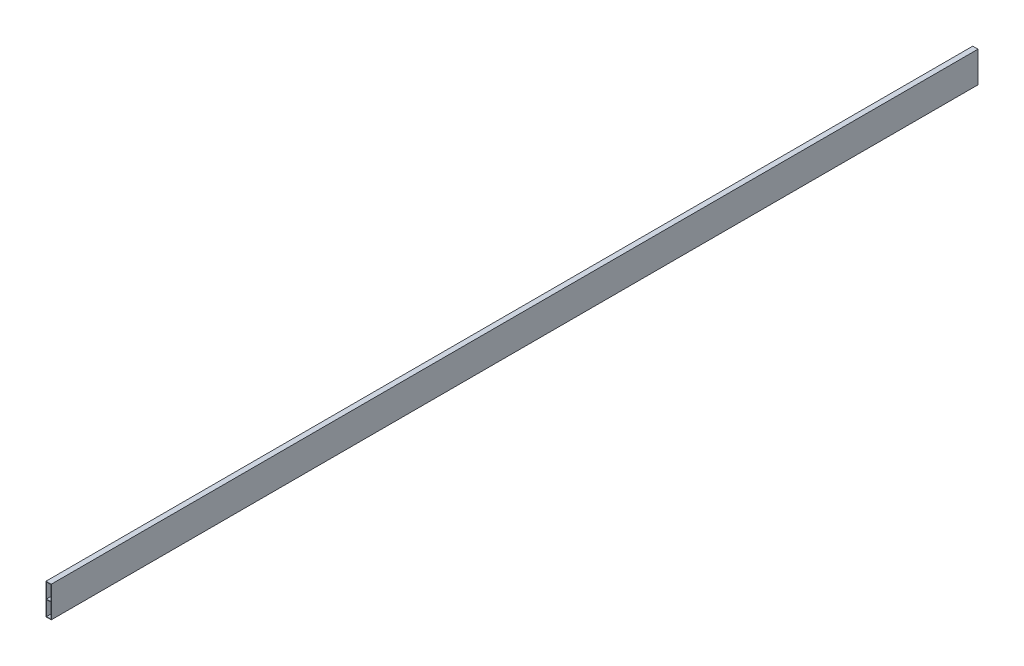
ISO-10303-21;
HEADER;
FILE_DESCRIPTION(('STEP AP214'),'2;1');
FILE_NAME('part.step','',(''),(''),'','','');
FILE_SCHEMA(('AUTOMOTIVE_DESIGN { 1 0 10303 214 1 1 1 1 }'));
ENDSEC;
DATA;
#1=APPLICATION_CONTEXT('core data for automotive mechanical design processes');
#2=APPLICATION_PROTOCOL_DEFINITION('international standard','automotive_design',2000,#1);
#3=PRODUCT_CONTEXT('',#1,'mechanical');
#4=PRODUCT('Part','Part','',(#3));
#5=PRODUCT_RELATED_PRODUCT_CATEGORY('part','',(#4));
#6=PRODUCT_DEFINITION_FORMATION('','',#4);
#7=PRODUCT_DEFINITION_CONTEXT('part definition',#1,'design');
#8=PRODUCT_DEFINITION('design','',#6,#7);
#9=PRODUCT_DEFINITION_SHAPE('','',#8);
#10=(LENGTH_UNIT() NAMED_UNIT(*) SI_UNIT(.MILLI.,.METRE.));
#11=(NAMED_UNIT(*) PLANE_ANGLE_UNIT() SI_UNIT($,.RADIAN.));
#12=(NAMED_UNIT(*) SI_UNIT($,.STERADIAN.) SOLID_ANGLE_UNIT());
#13=UNCERTAINTY_MEASURE_WITH_UNIT(LENGTH_MEASURE(1.E-05),#10,'distance_accuracy_value','');
#14=(GEOMETRIC_REPRESENTATION_CONTEXT(3) GLOBAL_UNCERTAINTY_ASSIGNED_CONTEXT((#13)) GLOBAL_UNIT_ASSIGNED_CONTEXT((#10,
#11,#12)) REPRESENTATION_CONTEXT('',''));
#15=CARTESIAN_POINT('',(0.,0.,0.));
#16=DIRECTION('',(0.,0.,1.));
#17=DIRECTION('',(1.,0.,0.));
#18=AXIS2_PLACEMENT_3D('',#15,#16,#17);
#19=CARTESIAN_POINT('',(-7.00000000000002,50.,3000.));
#20=DIRECTION('',(1.,0.,0.));
#21=DIRECTION('',(0.,0.,-1.));
#22=AXIS2_PLACEMENT_3D('',#19,#20,#21);
#23=PLANE('',#22);
#24=DIRECTION('',(0.,-1.,0.));
#25=VECTOR('',#24,1.);
#26=CARTESIAN_POINT('',(-7.00000000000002,50.,0.));
#27=LINE('',#26,#25);
#28=CARTESIAN_POINT('',(-7.00000000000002,-0.75,0.));
#29=VERTEX_POINT('',#28);
#30=CARTESIAN_POINT('',(-7.00000000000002,-48.5,0.));
#31=VERTEX_POINT('',#30);
#32=EDGE_CURVE('E271',#29,#31,#27,.T.);
#33=ORIENTED_EDGE('',*,*,#32,.F.);
#34=DIRECTION('',(0.,0.,-1.));
#35=VECTOR('',#34,1.);
#36=CARTESIAN_POINT('',(-7.00000000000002,-0.75,3014.08012784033));
#37=LINE('',#36,#35);
#38=CARTESIAN_POINT('',(-7.00000000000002,-0.750000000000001,3000.));
#39=VERTEX_POINT('',#38);
#40=EDGE_CURVE('E277',#39,#29,#37,.T.);
#41=ORIENTED_EDGE('',*,*,#40,.F.);
#42=DIRECTION('',(0.,-1.,0.));
#43=VECTOR('',#42,1.);
#44=CARTESIAN_POINT('',(-7.00000000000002,50.,3000.));
#45=LINE('',#44,#43);
#46=CARTESIAN_POINT('',(-7.00000000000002,-48.5,3000.));
#47=VERTEX_POINT('',#46);
#48=EDGE_CURVE('E163',#39,#47,#45,.T.);
#49=ORIENTED_EDGE('',*,*,#48,.T.);
#50=DIRECTION('',(0.,0.,-1.));
#51=VECTOR('',#50,1.);
#52=CARTESIAN_POINT('',(-7.00000000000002,-48.5,3000.));
#53=LINE('',#52,#51);
#54=EDGE_CURVE('E181',#47,#31,#53,.T.);
#55=ORIENTED_EDGE('',*,*,#54,.T.);
#56=EDGE_LOOP('',(#33,#41,#49,#55));
#57=FACE_BOUND('',#56,.T.);
#58=ADVANCED_FACE('F50',(#57),#23,.T.);
#59=CARTESIAN_POINT('',(6.99999999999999,50.,3000.));
#60=DIRECTION('',(-1.,0.,0.));
#61=DIRECTION('',(0.,0.,1.));
#62=AXIS2_PLACEMENT_3D('',#59,#60,#61);
#63=PLANE('',#62);
#64=DIRECTION('',(0.,1.,0.));
#65=VECTOR('',#64,1.);
#66=CARTESIAN_POINT('',(6.99999999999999,50.,3000.));
#67=LINE('',#66,#65);
#68=CARTESIAN_POINT('',(6.99999999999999,-48.5,3000.));
#69=VERTEX_POINT('',#68);
#70=CARTESIAN_POINT('',(6.99999999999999,-0.75,3000.));
#71=VERTEX_POINT('',#70);
#72=EDGE_CURVE('E170',#69,#71,#67,.T.);
#73=ORIENTED_EDGE('',*,*,#72,.T.);
#74=DIRECTION('',(0.,0.,-1.));
#75=VECTOR('',#74,1.);
#76=CARTESIAN_POINT('',(6.99999999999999,-0.75,3014.08012784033));
#77=LINE('',#76,#75);
#78=CARTESIAN_POINT('',(6.99999999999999,-0.750000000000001,0.));
#79=VERTEX_POINT('',#78);
#80=EDGE_CURVE('E343',#71,#79,#77,.T.);
#81=ORIENTED_EDGE('',*,*,#80,.T.);
#82=DIRECTION('',(0.,1.,0.));
#83=VECTOR('',#82,1.);
#84=CARTESIAN_POINT('',(6.99999999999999,50.,0.));
#85=LINE('',#84,#83);
#86=CARTESIAN_POINT('',(6.99999999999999,-48.5,0.));
#87=VERTEX_POINT('',#86);
#88=EDGE_CURVE('E278',#87,#79,#85,.T.);
#89=ORIENTED_EDGE('',*,*,#88,.F.);
#90=DIRECTION('',(0.,0.,-1.));
#91=VECTOR('',#90,1.);
#92=CARTESIAN_POINT('',(6.99999999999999,-48.5,3000.));
#93=LINE('',#92,#91);
#94=EDGE_CURVE('E179',#69,#87,#93,.T.);
#95=ORIENTED_EDGE('',*,*,#94,.F.);
#96=EDGE_LOOP('',(#73,#81,#89,#95));
#97=FACE_BOUND('',#96,.T.);
#98=ADVANCED_FACE('F236',(#97),#63,.T.);
#99=CARTESIAN_POINT('',(-8.50000000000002,-50.,3000.));
#100=DIRECTION('',(0.,0.,1.));
#101=DIRECTION('',(1.,0.,0.));
#102=AXIS2_PLACEMENT_3D('',#99,#100,#101);
#103=PLANE('',#102);
#104=DIRECTION('',(1.,0.,0.));
#105=VECTOR('',#104,1.);
#106=CARTESIAN_POINT('',(-7.00000000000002,0.75,3000.));
#107=LINE('',#106,#105);
#108=CARTESIAN_POINT('',(-7.00000000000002,0.75,3000.));
#109=VERTEX_POINT('',#108);
#110=CARTESIAN_POINT('',(6.99999999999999,0.75,3000.));
#111=VERTEX_POINT('',#110);
#112=EDGE_CURVE('E138',#109,#111,#107,.T.);
#113=ORIENTED_EDGE('',*,*,#112,.F.);
#114=CARTESIAN_POINT('',(-7.00000000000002,48.5,3000.));
#115=VERTEX_POINT('',#114);
#116=EDGE_CURVE('E144',#115,#109,#45,.T.);
#117=ORIENTED_EDGE('',*,*,#116,.F.);
#118=DIRECTION('',(-1.,0.,0.));
#119=VECTOR('',#118,1.);
#120=CARTESIAN_POINT('',(-8.50000000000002,48.5,3000.));
#121=LINE('',#120,#119);
#122=CARTESIAN_POINT('',(6.99999999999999,48.5,3000.));
#123=VERTEX_POINT('',#122);
#124=EDGE_CURVE('E173',#123,#115,#121,.T.);
#125=ORIENTED_EDGE('',*,*,#124,.F.);
#126=EDGE_CURVE('E145',#111,#123,#67,.T.);
#127=ORIENTED_EDGE('',*,*,#126,.F.);
#128=EDGE_LOOP('',(#113,#117,#125,#127));
#129=FACE_BOUND('',#128,.T.);
#130=DIRECTION('',(0.,-1.,0.));
#131=VECTOR('',#130,1.);
#132=CARTESIAN_POINT('',(-8.50000000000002,50.,3000.));
#133=LINE('',#132,#131);
#134=CARTESIAN_POINT('',(-8.50000000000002,50.,3000.));
#135=VERTEX_POINT('',#134);
#136=CARTESIAN_POINT('',(-8.50000000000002,-50.,3000.));
#137=VERTEX_POINT('',#136);
#138=EDGE_CURVE('E193',#135,#137,#133,.T.);
#139=ORIENTED_EDGE('',*,*,#138,.T.);
#140=DIRECTION('',(1.,0.,0.));
#141=VECTOR('',#140,1.);
#142=CARTESIAN_POINT('',(-8.50000000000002,-50.,3000.));
#143=LINE('',#142,#141);
#144=CARTESIAN_POINT('',(8.49999999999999,-50.,3000.));
#145=VERTEX_POINT('',#144);
#146=EDGE_CURVE('E196',#137,#145,#143,.T.);
#147=ORIENTED_EDGE('',*,*,#146,.T.);
#148=DIRECTION('',(0.,1.,0.));
#149=VECTOR('',#148,1.);
#150=CARTESIAN_POINT('',(8.49999999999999,50.,3000.));
#151=LINE('',#150,#149);
#152=CARTESIAN_POINT('',(8.49999999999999,50.,3000.));
#153=VERTEX_POINT('',#152);
#154=EDGE_CURVE('E198',#145,#153,#151,.T.);
#155=ORIENTED_EDGE('',*,*,#154,.T.);
#156=DIRECTION('',(-1.,0.,0.));
#157=VECTOR('',#156,1.);
#158=CARTESIAN_POINT('',(-8.50000000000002,50.,3000.));
#159=LINE('',#158,#157);
#160=EDGE_CURVE('E200',#153,#135,#159,.T.);
#161=ORIENTED_EDGE('',*,*,#160,.T.);
#162=EDGE_LOOP('',(#139,#147,#155,#161));
#163=FACE_BOUND('',#162,.T.);
#164=DIRECTION('',(1.,0.,0.));
#165=VECTOR('',#164,1.);
#166=CARTESIAN_POINT('',(-8.50000000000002,-48.5,3000.));
#167=LINE('',#166,#165);
#168=EDGE_CURVE('E162',#47,#69,#167,.T.);
#169=ORIENTED_EDGE('',*,*,#168,.F.);
#170=ORIENTED_EDGE('',*,*,#48,.F.);
#171=DIRECTION('',(1.,0.,0.));
#172=VECTOR('',#171,1.);
#173=CARTESIAN_POINT('',(-7.00000000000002,-0.75,3000.));
#174=LINE('',#173,#172);
#175=EDGE_CURVE('E65',#39,#71,#174,.T.);
#176=ORIENTED_EDGE('',*,*,#175,.T.);
#177=ORIENTED_EDGE('',*,*,#72,.F.);
#178=EDGE_LOOP('',(#169,#170,#176,#177));
#179=FACE_BOUND('',#178,.T.);
#180=ADVANCED_FACE('F140',(#129,#163,#179),#103,.T.);
#181=CARTESIAN_POINT('',(-8.50000000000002,-50.,0.));
#182=DIRECTION('',(0.,0.,1.));
#183=DIRECTION('',(1.,0.,0.));
#184=AXIS2_PLACEMENT_3D('',#181,#182,#183);
#185=PLANE('',#184);
#186=CARTESIAN_POINT('',(-7.00000000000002,48.5,0.));
#187=VERTEX_POINT('',#186);
#188=CARTESIAN_POINT('',(-7.00000000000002,0.75,0.));
#189=VERTEX_POINT('',#188);
#190=EDGE_CURVE('E267',#187,#189,#27,.T.);
#191=ORIENTED_EDGE('',*,*,#190,.T.);
#192=DIRECTION('',(1.,0.,0.));
#193=VECTOR('',#192,1.);
#194=CARTESIAN_POINT('',(-7.00000000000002,0.75,0.));
#195=LINE('',#194,#193);
#196=CARTESIAN_POINT('',(6.99999999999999,0.75,0.));
#197=VERTEX_POINT('',#196);
#198=EDGE_CURVE('E154',#189,#197,#195,.T.);
#199=ORIENTED_EDGE('',*,*,#198,.T.);
#200=CARTESIAN_POINT('',(6.99999999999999,48.5,0.));
#201=VERTEX_POINT('',#200);
#202=EDGE_CURVE('E274',#197,#201,#85,.T.);
#203=ORIENTED_EDGE('',*,*,#202,.T.);
#204=DIRECTION('',(-1.,0.,0.));
#205=VECTOR('',#204,1.);
#206=CARTESIAN_POINT('',(-8.50000000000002,48.5,0.));
#207=LINE('',#206,#205);
#208=EDGE_CURVE('E166',#201,#187,#207,.T.);
#209=ORIENTED_EDGE('',*,*,#208,.T.);
#210=EDGE_LOOP('',(#191,#199,#203,#209));
#211=FACE_BOUND('',#210,.T.);
#212=DIRECTION('',(0.,-1.,0.));
#213=VECTOR('',#212,1.);
#214=CARTESIAN_POINT('',(-8.50000000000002,50.,0.));
#215=LINE('',#214,#213);
#216=CARTESIAN_POINT('',(-8.50000000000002,50.,0.));
#217=VERTEX_POINT('',#216);
#218=CARTESIAN_POINT('',(-8.50000000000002,-50.,0.));
#219=VERTEX_POINT('',#218);
#220=EDGE_CURVE('E184',#217,#219,#215,.T.);
#221=ORIENTED_EDGE('',*,*,#220,.F.);
#222=DIRECTION('',(-1.,0.,0.));
#223=VECTOR('',#222,1.);
#224=CARTESIAN_POINT('',(-8.50000000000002,50.,0.));
#225=LINE('',#224,#223);
#226=CARTESIAN_POINT('',(8.49999999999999,50.,0.));
#227=VERTEX_POINT('',#226);
#228=EDGE_CURVE('E191',#227,#217,#225,.T.);
#229=ORIENTED_EDGE('',*,*,#228,.F.);
#230=DIRECTION('',(0.,1.,0.));
#231=VECTOR('',#230,1.);
#232=CARTESIAN_POINT('',(8.49999999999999,50.,0.));
#233=LINE('',#232,#231);
#234=CARTESIAN_POINT('',(8.49999999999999,-50.,0.));
#235=VERTEX_POINT('',#234);
#236=EDGE_CURVE('E189',#235,#227,#233,.T.);
#237=ORIENTED_EDGE('',*,*,#236,.F.);
#238=DIRECTION('',(1.,0.,0.));
#239=VECTOR('',#238,1.);
#240=CARTESIAN_POINT('',(-8.50000000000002,-50.,0.));
#241=LINE('',#240,#239);
#242=EDGE_CURVE('E187',#219,#235,#241,.T.);
#243=ORIENTED_EDGE('',*,*,#242,.F.);
#244=EDGE_LOOP('',(#221,#229,#237,#243));
#245=FACE_BOUND('',#244,.T.);
#246=DIRECTION('',(1.,0.,0.));
#247=VECTOR('',#246,1.);
#248=CARTESIAN_POINT('',(-7.00000000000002,-0.75,0.));
#249=LINE('',#248,#247);
#250=EDGE_CURVE('E70',#29,#79,#249,.T.);
#251=ORIENTED_EDGE('',*,*,#250,.F.);
#252=ORIENTED_EDGE('',*,*,#32,.T.);
#253=DIRECTION('',(1.,0.,0.));
#254=VECTOR('',#253,1.);
#255=CARTESIAN_POINT('',(-8.50000000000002,-48.5,0.));
#256=LINE('',#255,#254);
#257=EDGE_CURVE('E270',#31,#87,#256,.T.);
#258=ORIENTED_EDGE('',*,*,#257,.T.);
#259=ORIENTED_EDGE('',*,*,#88,.T.);
#260=EDGE_LOOP('',(#251,#252,#258,#259));
#261=FACE_BOUND('',#260,.T.);
#262=ADVANCED_FACE('F218',(#211,#245,#261),#185,.F.);
#263=CARTESIAN_POINT('',(-8.50000000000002,50.,3000.));
#264=DIRECTION('',(1.,0.,0.));
#265=DIRECTION('',(0.,0.,-1.));
#266=AXIS2_PLACEMENT_3D('',#263,#264,#265);
#267=PLANE('',#266);
#268=ORIENTED_EDGE('',*,*,#220,.T.);
#269=DIRECTION('',(0.,0.,-1.));
#270=VECTOR('',#269,1.);
#271=CARTESIAN_POINT('',(-8.50000000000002,-50.,3000.));
#272=LINE('',#271,#270);
#273=EDGE_CURVE('E12',#137,#219,#272,.T.);
#274=ORIENTED_EDGE('',*,*,#273,.F.);
#275=ORIENTED_EDGE('',*,*,#138,.F.);
#276=DIRECTION('',(0.,0.,-1.));
#277=VECTOR('',#276,1.);
#278=CARTESIAN_POINT('',(-8.50000000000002,50.,3000.));
#279=LINE('',#278,#277);
#280=EDGE_CURVE('E202',#135,#217,#279,.T.);
#281=ORIENTED_EDGE('',*,*,#280,.T.);
#282=EDGE_LOOP('',(#268,#274,#275,#281));
#283=FACE_BOUND('',#282,.T.);
#284=ADVANCED_FACE('F52',(#283),#267,.F.);
#285=CARTESIAN_POINT('',(-8.50000000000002,-50.,3000.));
#286=DIRECTION('',(0.,1.,0.));
#287=DIRECTION('',(-1.,0.,0.));
#288=AXIS2_PLACEMENT_3D('',#285,#286,#287);
#289=PLANE('',#288);
#290=ORIENTED_EDGE('',*,*,#242,.T.);
#291=DIRECTION('',(0.,0.,-1.));
#292=VECTOR('',#291,1.);
#293=CARTESIAN_POINT('',(8.49999999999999,-50.,3000.));
#294=LINE('',#293,#292);
#295=EDGE_CURVE('E58',#145,#235,#294,.T.);
#296=ORIENTED_EDGE('',*,*,#295,.F.);
#297=ORIENTED_EDGE('',*,*,#146,.F.);
#298=ORIENTED_EDGE('',*,*,#273,.T.);
#299=EDGE_LOOP('',(#290,#296,#297,#298));
#300=FACE_BOUND('',#299,.T.);
#301=ADVANCED_FACE('F228',(#300),#289,.F.);
#302=CARTESIAN_POINT('',(8.49999999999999,50.,3000.));
#303=DIRECTION('',(-1.,0.,0.));
#304=DIRECTION('',(0.,0.,1.));
#305=AXIS2_PLACEMENT_3D('',#302,#303,#304);
#306=PLANE('',#305);
#307=ORIENTED_EDGE('',*,*,#236,.T.);
#308=DIRECTION('',(0.,0.,-1.));
#309=VECTOR('',#308,1.);
#310=CARTESIAN_POINT('',(8.49999999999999,50.,3000.));
#311=LINE('',#310,#309);
#312=EDGE_CURVE('E205',#153,#227,#311,.T.);
#313=ORIENTED_EDGE('',*,*,#312,.F.);
#314=ORIENTED_EDGE('',*,*,#154,.F.);
#315=ORIENTED_EDGE('',*,*,#295,.T.);
#316=EDGE_LOOP('',(#307,#313,#314,#315));
#317=FACE_BOUND('',#316,.T.);
#318=ADVANCED_FACE('F212',(#317),#306,.F.);
#319=CARTESIAN_POINT('',(-8.50000000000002,50.,3000.));
#320=DIRECTION('',(0.,-1.,0.));
#321=DIRECTION('',(1.,0.,0.));
#322=AXIS2_PLACEMENT_3D('',#319,#320,#321);
#323=PLANE('',#322);
#324=ORIENTED_EDGE('',*,*,#228,.T.);
#325=ORIENTED_EDGE('',*,*,#280,.F.);
#326=ORIENTED_EDGE('',*,*,#160,.F.);
#327=ORIENTED_EDGE('',*,*,#312,.T.);
#328=EDGE_LOOP('',(#324,#325,#326,#327));
#329=FACE_BOUND('',#328,.T.);
#330=ADVANCED_FACE('F222',(#329),#323,.F.);
#331=DIRECTION('',(0.,0.,-1.));
#332=VECTOR('',#331,1.);
#333=CARTESIAN_POINT('',(-7.00000000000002,0.75,3014.08012784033));
#334=LINE('',#333,#332);
#335=EDGE_CURVE('E149',#109,#189,#334,.T.);
#336=ORIENTED_EDGE('',*,*,#335,.T.);
#337=ORIENTED_EDGE('',*,*,#190,.F.);
#338=DIRECTION('',(0.,0.,-1.));
#339=VECTOR('',#338,1.);
#340=CARTESIAN_POINT('',(-7.00000000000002,48.5,3000.));
#341=LINE('',#340,#339);
#342=EDGE_CURVE('E161',#115,#187,#341,.T.);
#343=ORIENTED_EDGE('',*,*,#342,.F.);
#344=ORIENTED_EDGE('',*,*,#116,.T.);
#345=EDGE_LOOP('',(#336,#337,#343,#344));
#346=FACE_BOUND('',#345,.T.);
#347=ADVANCED_FACE('F159',(#346),#23,.T.);
#348=CARTESIAN_POINT('',(-8.50000000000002,-48.5,3000.));
#349=DIRECTION('',(0.,1.,0.));
#350=DIRECTION('',(-1.,0.,0.));
#351=AXIS2_PLACEMENT_3D('',#348,#349,#350);
#352=PLANE('',#351);
#353=ORIENTED_EDGE('',*,*,#257,.F.);
#354=ORIENTED_EDGE('',*,*,#54,.F.);
#355=ORIENTED_EDGE('',*,*,#168,.T.);
#356=ORIENTED_EDGE('',*,*,#94,.T.);
#357=EDGE_LOOP('',(#353,#354,#355,#356));
#358=FACE_BOUND('',#357,.T.);
#359=ADVANCED_FACE('F250',(#358),#352,.T.);
#360=DIRECTION('',(0.,0.,-1.));
#361=VECTOR('',#360,1.);
#362=CARTESIAN_POINT('',(6.99999999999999,0.75,3014.08012784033));
#363=LINE('',#362,#361);
#364=EDGE_CURVE('E148',#111,#197,#363,.T.);
#365=ORIENTED_EDGE('',*,*,#364,.F.);
#366=ORIENTED_EDGE('',*,*,#126,.T.);
#367=DIRECTION('',(0.,0.,-1.));
#368=VECTOR('',#367,1.);
#369=CARTESIAN_POINT('',(6.99999999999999,48.5,3000.));
#370=LINE('',#369,#368);
#371=EDGE_CURVE('E176',#123,#201,#370,.T.);
#372=ORIENTED_EDGE('',*,*,#371,.T.);
#373=ORIENTED_EDGE('',*,*,#202,.F.);
#374=EDGE_LOOP('',(#365,#366,#372,#373));
#375=FACE_BOUND('',#374,.T.);
#376=ADVANCED_FACE('F245',(#375),#63,.T.);
#377=CARTESIAN_POINT('',(-8.50000000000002,48.5,3000.));
#378=DIRECTION('',(0.,-1.,0.));
#379=DIRECTION('',(1.,0.,0.));
#380=AXIS2_PLACEMENT_3D('',#377,#378,#379);
#381=PLANE('',#380);
#382=ORIENTED_EDGE('',*,*,#208,.F.);
#383=ORIENTED_EDGE('',*,*,#371,.F.);
#384=ORIENTED_EDGE('',*,*,#124,.T.);
#385=ORIENTED_EDGE('',*,*,#342,.T.);
#386=EDGE_LOOP('',(#382,#383,#384,#385));
#387=FACE_BOUND('',#386,.T.);
#388=ADVANCED_FACE('F284',(#387),#381,.T.);
#389=CARTESIAN_POINT('',(-7.00000000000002,0.75,3014.08012784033));
#390=DIRECTION('',(0.,1.,0.));
#391=DIRECTION('',(0.,0.,1.));
#392=AXIS2_PLACEMENT_3D('',#389,#390,#391);
#393=PLANE('',#392);
#394=ORIENTED_EDGE('',*,*,#335,.F.);
#395=ORIENTED_EDGE('',*,*,#112,.T.);
#396=ORIENTED_EDGE('',*,*,#364,.T.);
#397=ORIENTED_EDGE('',*,*,#198,.F.);
#398=EDGE_LOOP('',(#394,#395,#396,#397));
#399=FACE_BOUND('',#398,.T.);
#400=ADVANCED_FACE('F152',(#399),#393,.T.);
#401=CARTESIAN_POINT('',(-7.00000000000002,-0.75,3014.08012784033));
#402=DIRECTION('',(0.,1.,0.));
#403=DIRECTION('',(0.,0.,1.));
#404=AXIS2_PLACEMENT_3D('',#401,#402,#403);
#405=PLANE('',#404);
#406=ORIENTED_EDGE('',*,*,#175,.F.);
#407=ORIENTED_EDGE('',*,*,#40,.T.);
#408=ORIENTED_EDGE('',*,*,#250,.T.);
#409=ORIENTED_EDGE('',*,*,#80,.F.);
#410=EDGE_LOOP('',(#406,#407,#408,#409));
#411=FACE_BOUND('',#410,.T.);
#412=ADVANCED_FACE('F289',(#411),#405,.F.);
#413=CLOSED_SHELL('',(#58,#98,#180,#262,#284,#301,#318,#330,#347,#359,#376,#388,#400,#412));
#414=MANIFOLD_SOLID_BREP('B2',#413);
#415=ADVANCED_BREP_SHAPE_REPRESENTATION('',(#18,#414),#14);
#416=SHAPE_DEFINITION_REPRESENTATION(#9,#415);
ENDSEC;
END-ISO-10303-21;
